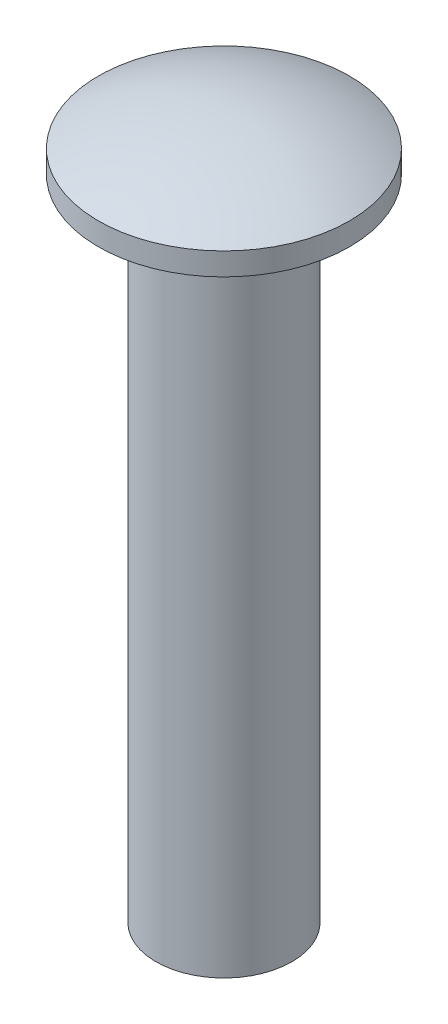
ISO-10303-21;
HEADER;
FILE_DESCRIPTION(('STEP AP214'),'2;1');
FILE_NAME('part.step','',(''),(''),'','','');
FILE_SCHEMA(('AUTOMOTIVE_DESIGN { 1 0 10303 214 1 1 1 1 }'));
ENDSEC;
DATA;
#1=APPLICATION_CONTEXT('core data for automotive mechanical design processes');
#2=APPLICATION_PROTOCOL_DEFINITION('international standard','automotive_design',2000,#1);
#3=PRODUCT_CONTEXT('',#1,'mechanical');
#4=PRODUCT('Part','Part','',(#3));
#5=PRODUCT_RELATED_PRODUCT_CATEGORY('part','',(#4));
#6=PRODUCT_DEFINITION_FORMATION('','',#4);
#7=PRODUCT_DEFINITION_CONTEXT('part definition',#1,'design');
#8=PRODUCT_DEFINITION('design','',#6,#7);
#9=PRODUCT_DEFINITION_SHAPE('','',#8);
#10=(LENGTH_UNIT() NAMED_UNIT(*) SI_UNIT(.MILLI.,.METRE.));
#11=(NAMED_UNIT(*) PLANE_ANGLE_UNIT() SI_UNIT($,.RADIAN.));
#12=(NAMED_UNIT(*) SI_UNIT($,.STERADIAN.) SOLID_ANGLE_UNIT());
#13=UNCERTAINTY_MEASURE_WITH_UNIT(LENGTH_MEASURE(1.E-05),#10,'distance_accuracy_value','');
#14=(GEOMETRIC_REPRESENTATION_CONTEXT(3) GLOBAL_UNCERTAINTY_ASSIGNED_CONTEXT((#13)) GLOBAL_UNIT_ASSIGNED_CONTEXT((#10,
#11,#12)) REPRESENTATION_CONTEXT('',''));
#15=CARTESIAN_POINT('',(0.,0.,0.));
#16=DIRECTION('',(0.,0.,1.));
#17=DIRECTION('',(1.,0.,0.));
#18=AXIS2_PLACEMENT_3D('',#15,#16,#17);
#19=CARTESIAN_POINT('',(1.4986,0.,0.));
#20=DIRECTION('',(0.,-1.,0.));
#21=DIRECTION('',(1.,0.,0.));
#22=AXIS2_PLACEMENT_3D('',#19,#20,#21);
#23=PLANE('',#22);
#24=CARTESIAN_POINT('',(0.,0.,0.));
#25=DIRECTION('',(0.,-1.,0.));
#26=DIRECTION('',(1.,0.,0.));
#27=AXIS2_PLACEMENT_3D('',#24,#25,#26);
#28=CIRCLE('',#27,1.4986);
#29=CARTESIAN_POINT('',(1.4986,0.,0.));
#30=VERTEX_POINT('',#29);
#31=EDGE_CURVE('E65',#30,#30,#28,.T.);
#32=ORIENTED_EDGE('',*,*,#31,.T.);
#33=EDGE_LOOP('',(#32));
#34=FACE_BOUND('',#33,.T.);
#35=CARTESIAN_POINT('',(0.,0.,0.));
#36=DIRECTION('',(0.,-1.,0.));
#37=DIRECTION('',(1.,0.,0.));
#38=AXIS2_PLACEMENT_3D('',#35,#36,#37);
#39=CIRCLE('',#38,1.0795);
#40=CARTESIAN_POINT('',(1.0795,0.,0.));
#41=VERTEX_POINT('',#40);
#42=EDGE_CURVE('E11',#41,#41,#39,.T.);
#43=ORIENTED_EDGE('',*,*,#42,.F.);
#44=EDGE_LOOP('',(#43));
#45=FACE_BOUND('',#44,.T.);
#46=ADVANCED_FACE('F34',(#34,#45),#23,.T.);
#47=CARTESIAN_POINT('',(0.,1.65972911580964,0.));
#48=DIRECTION('',(0.,-1.,0.));
#49=DIRECTION('',(1.,0.,0.));
#50=AXIS2_PLACEMENT_3D('',#47,#48,#49);
#51=CYLINDRICAL_SURFACE('',#50,1.0795);
#52=ORIENTED_EDGE('',*,*,#42,.T.);
#53=EDGE_LOOP('',(#52));
#54=FACE_BOUND('',#53,.T.);
#55=CARTESIAN_POINT('',(0.,1.21258557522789,0.));
#56=DIRECTION('',(0.,-1.,0.));
#57=DIRECTION('',(1.,0.,0.));
#58=AXIS2_PLACEMENT_3D('',#55,#56,#57);
#59=CIRCLE('',#58,1.0795);
#60=CARTESIAN_POINT('',(1.0795,1.21258557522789,0.));
#61=VERTEX_POINT('',#60);
#62=EDGE_CURVE('E40',#61,#61,#59,.T.);
#63=ORIENTED_EDGE('',*,*,#62,.F.);
#64=EDGE_LOOP('',(#63));
#65=FACE_BOUND('',#64,.T.);
#66=ADVANCED_FACE('F46',(#54,#65),#51,.F.);
#67=CARTESIAN_POINT('',(0.,1.65972911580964,0.));
#68=DIRECTION('',(0.,-1.,0.));
#69=DIRECTION('',(1.,0.,0.));
#70=AXIS2_PLACEMENT_3D('',#67,#68,#69);
#71=CONICAL_SURFACE('',#70,0.,1.17809724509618);
#72=ORIENTED_EDGE('',*,*,#62,.T.);
#73=EDGE_LOOP('',(#72));
#74=FACE_BOUND('',#73,.T.);
#75=CARTESIAN_POINT('',(0.,1.65972911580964,0.));
#76=VERTEX_POINT('',#75);
#77=VERTEX_LOOP('',#76);
#78=FACE_BOUND('',#77,.T.);
#79=ADVANCED_FACE('F43',(#74,#78),#71,.F.);
#80=CARTESIAN_POINT('',(0.,9.69024767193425,0.));
#81=DIRECTION('',(0.,-1.,0.));
#82=DIRECTION('',(1.,0.,0.));
#83=AXIS2_PLACEMENT_3D('',#80,#81,#82);
#84=SPHERICAL_SURFACE('',#83,5.79725232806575);
#85=CARTESIAN_POINT('',(0.,14.7836736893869,0.));
#86=DIRECTION('',(0.,-1.,0.));
#87=DIRECTION('',(1.,0.,0.));
#88=AXIS2_PLACEMENT_3D('',#85,#86,#87);
#89=CIRCLE('',#88,2.7686);
#90=CARTESIAN_POINT('',(2.7686,14.7836736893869,0.));
#91=VERTEX_POINT('',#90);
#92=EDGE_CURVE('E69',#91,#91,#89,.T.);
#93=ORIENTED_EDGE('',*,*,#92,.F.);
#94=EDGE_LOOP('',(#93));
#95=FACE_BOUND('',#94,.T.);
#96=ADVANCED_FACE('F45',(#95),#84,.T.);
#97=CARTESIAN_POINT('',(0.,1.65972911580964,0.));
#98=DIRECTION('',(0.,-1.,0.));
#99=DIRECTION('',(1.,0.,0.));
#100=AXIS2_PLACEMENT_3D('',#97,#98,#99);
#101=CYLINDRICAL_SURFACE('',#100,2.7686);
#102=ORIENTED_EDGE('',*,*,#92,.T.);
#103=EDGE_LOOP('',(#102));
#104=FACE_BOUND('',#103,.T.);
#105=CARTESIAN_POINT('',(0.,14.2875,0.));
#106=DIRECTION('',(0.,-1.,0.));
#107=DIRECTION('',(1.,0.,0.));
#108=AXIS2_PLACEMENT_3D('',#105,#106,#107);
#109=CIRCLE('',#108,2.7686);
#110=CARTESIAN_POINT('',(2.7686,14.2875,0.));
#111=VERTEX_POINT('',#110);
#112=EDGE_CURVE('E71',#111,#111,#109,.T.);
#113=ORIENTED_EDGE('',*,*,#112,.F.);
#114=EDGE_LOOP('',(#113));
#115=FACE_BOUND('',#114,.T.);
#116=ADVANCED_FACE('F53',(#104,#115),#101,.T.);
#117=CARTESIAN_POINT('',(2.7686,14.2875,0.));
#118=DIRECTION('',(0.,-1.,0.));
#119=DIRECTION('',(1.,0.,0.));
#120=AXIS2_PLACEMENT_3D('',#117,#118,#119);
#121=PLANE('',#120);
#122=ORIENTED_EDGE('',*,*,#112,.T.);
#123=EDGE_LOOP('',(#122));
#124=FACE_BOUND('',#123,.T.);
#125=CARTESIAN_POINT('',(0.,14.2875,0.));
#126=DIRECTION('',(0.,-1.,0.));
#127=DIRECTION('',(1.,0.,0.));
#128=AXIS2_PLACEMENT_3D('',#125,#126,#127);
#129=CIRCLE('',#128,1.4986);
#130=CARTESIAN_POINT('',(1.4986,14.2875,0.));
#131=VERTEX_POINT('',#130);
#132=EDGE_CURVE('E76',#131,#131,#129,.T.);
#133=ORIENTED_EDGE('',*,*,#132,.F.);
#134=EDGE_LOOP('',(#133));
#135=FACE_BOUND('',#134,.T.);
#136=ADVANCED_FACE('F84',(#124,#135),#121,.T.);
#137=CARTESIAN_POINT('',(0.,1.65972911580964,0.));
#138=DIRECTION('',(0.,-1.,0.));
#139=DIRECTION('',(1.,0.,0.));
#140=AXIS2_PLACEMENT_3D('',#137,#138,#139);
#141=CYLINDRICAL_SURFACE('',#140,1.4986);
#142=ORIENTED_EDGE('',*,*,#132,.T.);
#143=EDGE_LOOP('',(#142));
#144=FACE_BOUND('',#143,.T.);
#145=ORIENTED_EDGE('',*,*,#31,.F.);
#146=EDGE_LOOP('',(#145));
#147=FACE_BOUND('',#146,.T.);
#148=ADVANCED_FACE('F81',(#144,#147),#141,.T.);
#149=CLOSED_SHELL('',(#46,#66,#79,#96,#116,#136,#148));
#150=MANIFOLD_SOLID_BREP('B2',#149);
#151=ADVANCED_BREP_SHAPE_REPRESENTATION('',(#18,#150),#14);
#152=SHAPE_DEFINITION_REPRESENTATION(#9,#151);
ENDSEC;
END-ISO-10303-21;
